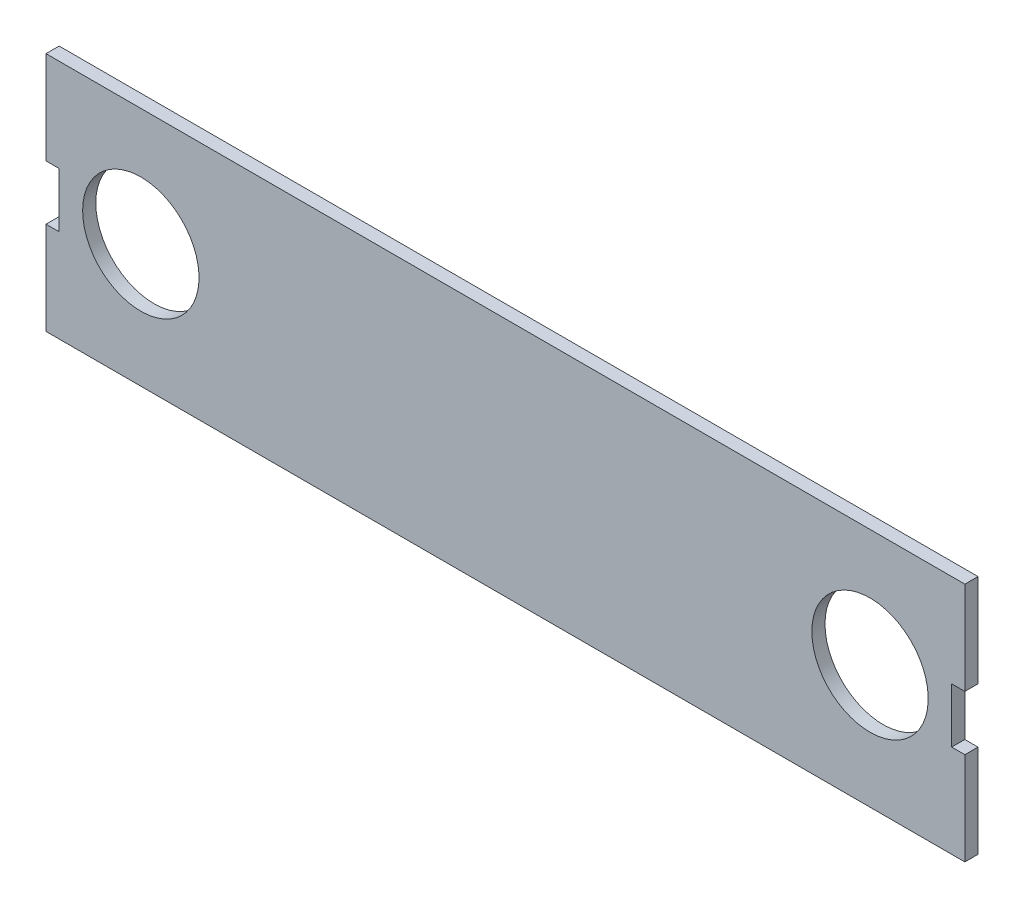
ISO-10303-21;
HEADER;
FILE_DESCRIPTION(('STEP AP214'),'2;1');
FILE_NAME('part.step','',(''),(''),'','','');
FILE_SCHEMA(('AUTOMOTIVE_DESIGN { 1 0 10303 214 1 1 1 1 }'));
ENDSEC;
DATA;
#1=APPLICATION_CONTEXT('core data for automotive mechanical design processes');
#2=APPLICATION_PROTOCOL_DEFINITION('international standard','automotive_design',2000,#1);
#3=PRODUCT_CONTEXT('',#1,'mechanical');
#4=PRODUCT('Part','Part','',(#3));
#5=PRODUCT_RELATED_PRODUCT_CATEGORY('part','',(#4));
#6=PRODUCT_DEFINITION_FORMATION('','',#4);
#7=PRODUCT_DEFINITION_CONTEXT('part definition',#1,'design');
#8=PRODUCT_DEFINITION('design','',#6,#7);
#9=PRODUCT_DEFINITION_SHAPE('','',#8);
#10=(LENGTH_UNIT() NAMED_UNIT(*) SI_UNIT(.MILLI.,.METRE.));
#11=(NAMED_UNIT(*) PLANE_ANGLE_UNIT() SI_UNIT($,.RADIAN.));
#12=(NAMED_UNIT(*) SI_UNIT($,.STERADIAN.) SOLID_ANGLE_UNIT());
#13=UNCERTAINTY_MEASURE_WITH_UNIT(LENGTH_MEASURE(1.E-05),#10,'distance_accuracy_value','');
#14=(GEOMETRIC_REPRESENTATION_CONTEXT(3) GLOBAL_UNCERTAINTY_ASSIGNED_CONTEXT((#13)) GLOBAL_UNIT_ASSIGNED_CONTEXT((#10,
#11,#12)) REPRESENTATION_CONTEXT('',''));
#15=CARTESIAN_POINT('',(0.,0.,0.));
#16=DIRECTION('',(0.,0.,1.));
#17=DIRECTION('',(1.,0.,0.));
#18=AXIS2_PLACEMENT_3D('',#15,#16,#17);
#19=CARTESIAN_POINT('',(0.,0.,1.524));
#20=DIRECTION('',(0.,0.,1.));
#21=DIRECTION('',(1.,0.,0.));
#22=AXIS2_PLACEMENT_3D('',#19,#20,#21);
#23=PLANE('',#22);
#24=CARTESIAN_POINT('',(9.46847857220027,-4.90502847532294,1.524));
#25=DIRECTION('',(0.,0.,1.));
#26=DIRECTION('',(1.,0.,0.));
#27=AXIS2_PLACEMENT_3D('',#24,#25,#26);
#28=CIRCLE('',#27,6.7437);
#29=CARTESIAN_POINT('',(2.72477857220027,-4.90502847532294,1.524));
#30=VERTEX_POINT('',#29);
#31=EDGE_CURVE('E161',#30,#30,#28,.T.);
#32=ORIENTED_EDGE('',*,*,#31,.F.);
#33=EDGE_LOOP('',(#32));
#34=FACE_BOUND('',#33,.T.);
#35=DIRECTION('',(0.,-1.,0.));
#36=VECTOR('',#35,1.);
#37=CARTESIAN_POINT('',(-1.524,8.71921233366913,1.524));
#38=LINE('',#37,#36);
#39=CARTESIAN_POINT('',(-1.524,8.71921233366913,1.524));
#40=VERTEX_POINT('',#39);
#41=CARTESIAN_POINT('',(-1.524,-2.05128085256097,1.524));
#42=VERTEX_POINT('',#41);
#43=EDGE_CURVE('E180',#40,#42,#38,.T.);
#44=ORIENTED_EDGE('',*,*,#43,.T.);
#45=DIRECTION('',(1.,0.,0.));
#46=VECTOR('',#45,1.);
#47=CARTESIAN_POINT('',(-1.524,-2.05128085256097,1.524));
#48=LINE('',#47,#46);
#49=CARTESIAN_POINT('',(0.,-2.05128085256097,1.524));
#50=VERTEX_POINT('',#49);
#51=EDGE_CURVE('E108',#42,#50,#48,.T.);
#52=ORIENTED_EDGE('',*,*,#51,.T.);
#53=DIRECTION('',(0.,-1.,0.));
#54=VECTOR('',#53,1.);
#55=CARTESIAN_POINT('',(0.,-2.05128085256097,1.524));
#56=LINE('',#55,#54);
#57=CARTESIAN_POINT('',(0.,-8.40128085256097,1.524));
#58=VERTEX_POINT('',#57);
#59=EDGE_CURVE('E207',#50,#58,#56,.T.);
#60=ORIENTED_EDGE('',*,*,#59,.T.);
#61=DIRECTION('',(-1.,0.,0.));
#62=VECTOR('',#61,1.);
#63=CARTESIAN_POINT('',(0.,-8.40128085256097,1.524));
#64=LINE('',#63,#62);
#65=CARTESIAN_POINT('',(-1.524,-8.40128085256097,1.524));
#66=VERTEX_POINT('',#65);
#67=EDGE_CURVE('E226',#58,#66,#64,.T.);
#68=ORIENTED_EDGE('',*,*,#67,.T.);
#69=DIRECTION('',(0.,-1.,0.));
#70=VECTOR('',#69,1.);
#71=CARTESIAN_POINT('',(-1.524,-8.40128085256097,1.524));
#72=LINE('',#71,#70);
#73=CARTESIAN_POINT('',(-1.524,-19.1717740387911,1.524));
#74=VERTEX_POINT('',#73);
#75=EDGE_CURVE('E223',#66,#74,#72,.T.);
#76=ORIENTED_EDGE('',*,*,#75,.T.);
#77=DIRECTION('',(1.,0.,0.));
#78=VECTOR('',#77,1.);
#79=CARTESIAN_POINT('',(-1.524,-19.1717740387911,1.524));
#80=LINE('',#79,#78);
#81=CARTESIAN_POINT('',(104.993300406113,-19.1717740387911,1.524));
#82=VERTEX_POINT('',#81);
#83=EDGE_CURVE('E225',#74,#82,#80,.T.);
#84=ORIENTED_EDGE('',*,*,#83,.T.);
#85=DIRECTION('',(0.,1.,0.));
#86=VECTOR('',#85,1.);
#87=CARTESIAN_POINT('',(104.993300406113,-8.40128085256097,1.524));
#88=LINE('',#87,#86);
#89=CARTESIAN_POINT('',(104.993300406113,-8.40128085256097,1.524));
#90=VERTEX_POINT('',#89);
#91=EDGE_CURVE('E228',#82,#90,#88,.T.);
#92=ORIENTED_EDGE('',*,*,#91,.T.);
#93=DIRECTION('',(-1.,0.,0.));
#94=VECTOR('',#93,1.);
#95=CARTESIAN_POINT('',(103.469300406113,-8.40128085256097,1.524));
#96=LINE('',#95,#94);
#97=CARTESIAN_POINT('',(103.469300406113,-8.40128085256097,1.524));
#98=VERTEX_POINT('',#97);
#99=EDGE_CURVE('E234',#90,#98,#96,.T.);
#100=ORIENTED_EDGE('',*,*,#99,.T.);
#101=DIRECTION('',(0.,1.,0.));
#102=VECTOR('',#101,1.);
#103=CARTESIAN_POINT('',(103.469300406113,-2.05128085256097,1.524));
#104=LINE('',#103,#102);
#105=CARTESIAN_POINT('',(103.469300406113,-2.05128085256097,1.524));
#106=VERTEX_POINT('',#105);
#107=EDGE_CURVE('E139',#98,#106,#104,.T.);
#108=ORIENTED_EDGE('',*,*,#107,.T.);
#109=DIRECTION('',(1.,0.,0.));
#110=VECTOR('',#109,1.);
#111=CARTESIAN_POINT('',(104.993300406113,-2.05128085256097,1.524));
#112=LINE('',#111,#110);
#113=CARTESIAN_POINT('',(104.993300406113,-2.05128085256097,1.524));
#114=VERTEX_POINT('',#113);
#115=EDGE_CURVE('E133',#106,#114,#112,.T.);
#116=ORIENTED_EDGE('',*,*,#115,.T.);
#117=DIRECTION('',(0.,1.,0.));
#118=VECTOR('',#117,1.);
#119=CARTESIAN_POINT('',(104.993300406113,8.71921233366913,1.524));
#120=LINE('',#119,#118);
#121=CARTESIAN_POINT('',(104.993300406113,8.71921233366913,1.524));
#122=VERTEX_POINT('',#121);
#123=EDGE_CURVE('E137',#114,#122,#120,.T.);
#124=ORIENTED_EDGE('',*,*,#123,.T.);
#125=DIRECTION('',(-1.,0.,0.));
#126=VECTOR('',#125,1.);
#127=CARTESIAN_POINT('',(-1.524,8.71921233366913,1.524));
#128=LINE('',#127,#126);
#129=EDGE_CURVE('E53',#122,#40,#128,.T.);
#130=ORIENTED_EDGE('',*,*,#129,.T.);
#131=EDGE_LOOP('',(#44,#52,#60,#68,#76,#84,#92,#100,#108,#116,#124,#130));
#132=FACE_BOUND('',#131,.T.);
#133=CARTESIAN_POINT('',(94.0008218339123,-4.90502847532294,1.524));
#134=DIRECTION('',(0.,0.,1.));
#135=DIRECTION('',(-1.,0.,0.));
#136=AXIS2_PLACEMENT_3D('',#133,#134,#135);
#137=CIRCLE('',#136,6.74369999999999);
#138=CARTESIAN_POINT('',(87.2571218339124,-4.90502847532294,1.524));
#139=VERTEX_POINT('',#138);
#140=EDGE_CURVE('E277',#139,#139,#137,.T.);
#141=ORIENTED_EDGE('',*,*,#140,.F.);
#142=EDGE_LOOP('',(#141));
#143=FACE_BOUND('',#142,.T.);
#144=ADVANCED_FACE('F36',(#34,#132,#143),#23,.T.);
#145=CARTESIAN_POINT('',(0.,0.,0.));
#146=DIRECTION('',(0.,0.,1.));
#147=DIRECTION('',(1.,0.,0.));
#148=AXIS2_PLACEMENT_3D('',#145,#146,#147);
#149=PLANE('',#148);
#150=CARTESIAN_POINT('',(9.46847857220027,-4.90502847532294,0.));
#151=DIRECTION('',(0.,0.,1.));
#152=DIRECTION('',(1.,0.,0.));
#153=AXIS2_PLACEMENT_3D('',#150,#151,#152);
#154=CIRCLE('',#153,6.7437);
#155=CARTESIAN_POINT('',(2.72477857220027,-4.90502847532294,0.));
#156=VERTEX_POINT('',#155);
#157=EDGE_CURVE('E282',#156,#156,#154,.T.);
#158=ORIENTED_EDGE('',*,*,#157,.T.);
#159=EDGE_LOOP('',(#158));
#160=FACE_BOUND('',#159,.T.);
#161=DIRECTION('',(0.,-1.,0.));
#162=VECTOR('',#161,1.);
#163=CARTESIAN_POINT('',(-1.524,8.71921233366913,0.));
#164=LINE('',#163,#162);
#165=CARTESIAN_POINT('',(-1.524,8.71921233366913,0.));
#166=VERTEX_POINT('',#165);
#167=CARTESIAN_POINT('',(-1.524,-2.05128085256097,0.));
#168=VERTEX_POINT('',#167);
#169=EDGE_CURVE('E157',#166,#168,#164,.T.);
#170=ORIENTED_EDGE('',*,*,#169,.F.);
#171=DIRECTION('',(-1.,0.,0.));
#172=VECTOR('',#171,1.);
#173=CARTESIAN_POINT('',(-1.524,8.71921233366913,0.));
#174=LINE('',#173,#172);
#175=CARTESIAN_POINT('',(104.993300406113,8.71921233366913,0.));
#176=VERTEX_POINT('',#175);
#177=EDGE_CURVE('E100',#176,#166,#174,.T.);
#178=ORIENTED_EDGE('',*,*,#177,.F.);
#179=DIRECTION('',(0.,1.,0.));
#180=VECTOR('',#179,1.);
#181=CARTESIAN_POINT('',(104.993300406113,8.71921233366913,0.));
#182=LINE('',#181,#180);
#183=CARTESIAN_POINT('',(104.993300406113,-2.05128085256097,0.));
#184=VERTEX_POINT('',#183);
#185=EDGE_CURVE('E94',#184,#176,#182,.T.);
#186=ORIENTED_EDGE('',*,*,#185,.F.);
#187=DIRECTION('',(1.,0.,0.));
#188=VECTOR('',#187,1.);
#189=CARTESIAN_POINT('',(104.993300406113,-2.05128085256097,0.));
#190=LINE('',#189,#188);
#191=CARTESIAN_POINT('',(103.469300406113,-2.05128085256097,0.));
#192=VERTEX_POINT('',#191);
#193=EDGE_CURVE('E147',#192,#184,#190,.T.);
#194=ORIENTED_EDGE('',*,*,#193,.F.);
#195=DIRECTION('',(0.,1.,0.));
#196=VECTOR('',#195,1.);
#197=CARTESIAN_POINT('',(103.469300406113,-2.05128085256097,0.));
#198=LINE('',#197,#196);
#199=CARTESIAN_POINT('',(103.469300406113,-8.40128085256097,0.));
#200=VERTEX_POINT('',#199);
#201=EDGE_CURVE('E175',#200,#192,#198,.T.);
#202=ORIENTED_EDGE('',*,*,#201,.F.);
#203=DIRECTION('',(-1.,0.,0.));
#204=VECTOR('',#203,1.);
#205=CARTESIAN_POINT('',(103.469300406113,-8.40128085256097,0.));
#206=LINE('',#205,#204);
#207=CARTESIAN_POINT('',(104.993300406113,-8.40128085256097,0.));
#208=VERTEX_POINT('',#207);
#209=EDGE_CURVE('E173',#208,#200,#206,.T.);
#210=ORIENTED_EDGE('',*,*,#209,.F.);
#211=DIRECTION('',(0.,1.,0.));
#212=VECTOR('',#211,1.);
#213=CARTESIAN_POINT('',(104.993300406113,-8.40128085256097,0.));
#214=LINE('',#213,#212);
#215=CARTESIAN_POINT('',(104.993300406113,-19.1717740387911,0.));
#216=VERTEX_POINT('',#215);
#217=EDGE_CURVE('E171',#216,#208,#214,.T.);
#218=ORIENTED_EDGE('',*,*,#217,.F.);
#219=DIRECTION('',(1.,0.,0.));
#220=VECTOR('',#219,1.);
#221=CARTESIAN_POINT('',(-1.524,-19.1717740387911,0.));
#222=LINE('',#221,#220);
#223=CARTESIAN_POINT('',(-1.524,-19.1717740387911,0.));
#224=VERTEX_POINT('',#223);
#225=EDGE_CURVE('E169',#224,#216,#222,.T.);
#226=ORIENTED_EDGE('',*,*,#225,.F.);
#227=DIRECTION('',(0.,-1.,0.));
#228=VECTOR('',#227,1.);
#229=CARTESIAN_POINT('',(-1.524,-8.40128085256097,0.));
#230=LINE('',#229,#228);
#231=CARTESIAN_POINT('',(-1.524,-8.40128085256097,0.));
#232=VERTEX_POINT('',#231);
#233=EDGE_CURVE('E167',#232,#224,#230,.T.);
#234=ORIENTED_EDGE('',*,*,#233,.F.);
#235=DIRECTION('',(-1.,0.,0.));
#236=VECTOR('',#235,1.);
#237=CARTESIAN_POINT('',(0.,-8.40128085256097,0.));
#238=LINE('',#237,#236);
#239=CARTESIAN_POINT('',(0.,-8.40128085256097,0.));
#240=VERTEX_POINT('',#239);
#241=EDGE_CURVE('E165',#240,#232,#238,.T.);
#242=ORIENTED_EDGE('',*,*,#241,.F.);
#243=DIRECTION('',(0.,-1.,0.));
#244=VECTOR('',#243,1.);
#245=CARTESIAN_POINT('',(0.,-2.05128085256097,0.));
#246=LINE('',#245,#244);
#247=CARTESIAN_POINT('',(0.,-2.05128085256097,0.));
#248=VERTEX_POINT('',#247);
#249=EDGE_CURVE('E163',#248,#240,#246,.T.);
#250=ORIENTED_EDGE('',*,*,#249,.F.);
#251=DIRECTION('',(1.,0.,0.));
#252=VECTOR('',#251,1.);
#253=CARTESIAN_POINT('',(-1.524,-2.05128085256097,0.));
#254=LINE('',#253,#252);
#255=EDGE_CURVE('E160',#168,#248,#254,.T.);
#256=ORIENTED_EDGE('',*,*,#255,.F.);
#257=EDGE_LOOP('',(#170,#178,#186,#194,#202,#210,#218,#226,#234,#242,#250,#256));
#258=FACE_BOUND('',#257,.T.);
#259=CARTESIAN_POINT('',(94.0008218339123,-4.90502847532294,0.));
#260=DIRECTION('',(0.,0.,1.));
#261=DIRECTION('',(-1.,0.,0.));
#262=AXIS2_PLACEMENT_3D('',#259,#260,#261);
#263=CIRCLE('',#262,6.74369999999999);
#264=CARTESIAN_POINT('',(87.2571218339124,-4.90502847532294,0.));
#265=VERTEX_POINT('',#264);
#266=EDGE_CURVE('E280',#265,#265,#263,.T.);
#267=ORIENTED_EDGE('',*,*,#266,.T.);
#268=EDGE_LOOP('',(#267));
#269=FACE_BOUND('',#268,.T.);
#270=ADVANCED_FACE('F211',(#160,#258,#269),#149,.F.);
#271=CARTESIAN_POINT('',(-1.524,8.71921233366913,1.524));
#272=DIRECTION('',(1.,0.,0.));
#273=DIRECTION('',(0.,0.,-1.));
#274=AXIS2_PLACEMENT_3D('',#271,#272,#273);
#275=PLANE('',#274);
#276=ORIENTED_EDGE('',*,*,#169,.T.);
#277=DIRECTION('',(0.,0.,-1.));
#278=VECTOR('',#277,1.);
#279=CARTESIAN_POINT('',(-1.524,-2.05128085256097,1.524));
#280=LINE('',#279,#278);
#281=EDGE_CURVE('E11',#42,#168,#280,.T.);
#282=ORIENTED_EDGE('',*,*,#281,.F.);
#283=ORIENTED_EDGE('',*,*,#43,.F.);
#284=DIRECTION('',(0.,0.,-1.));
#285=VECTOR('',#284,1.);
#286=CARTESIAN_POINT('',(-1.524,8.71921233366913,1.524));
#287=LINE('',#286,#285);
#288=EDGE_CURVE('E153',#40,#166,#287,.T.);
#289=ORIENTED_EDGE('',*,*,#288,.T.);
#290=EDGE_LOOP('',(#276,#282,#283,#289));
#291=FACE_BOUND('',#290,.T.);
#292=ADVANCED_FACE('F38',(#291),#275,.F.);
#293=CARTESIAN_POINT('',(-1.524,-2.05128085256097,1.524));
#294=DIRECTION('',(0.,1.,0.));
#295=DIRECTION('',(0.,0.,1.));
#296=AXIS2_PLACEMENT_3D('',#293,#294,#295);
#297=PLANE('',#296);
#298=ORIENTED_EDGE('',*,*,#255,.T.);
#299=DIRECTION('',(0.,0.,-1.));
#300=VECTOR('',#299,1.);
#301=CARTESIAN_POINT('',(0.,-2.05128085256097,1.524));
#302=LINE('',#301,#300);
#303=EDGE_CURVE('E45',#50,#248,#302,.T.);
#304=ORIENTED_EDGE('',*,*,#303,.F.);
#305=ORIENTED_EDGE('',*,*,#51,.F.);
#306=ORIENTED_EDGE('',*,*,#281,.T.);
#307=EDGE_LOOP('',(#298,#304,#305,#306));
#308=FACE_BOUND('',#307,.T.);
#309=ADVANCED_FACE('F375',(#308),#297,.F.);
#310=CARTESIAN_POINT('',(0.,-2.05128085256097,1.524));
#311=DIRECTION('',(1.,0.,0.));
#312=DIRECTION('',(0.,0.,-1.));
#313=AXIS2_PLACEMENT_3D('',#310,#311,#312);
#314=PLANE('',#313);
#315=ORIENTED_EDGE('',*,*,#249,.T.);
#316=DIRECTION('',(0.,0.,-1.));
#317=VECTOR('',#316,1.);
#318=CARTESIAN_POINT('',(0.,-8.40128085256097,1.524));
#319=LINE('',#318,#317);
#320=EDGE_CURVE('E199',#58,#240,#319,.T.);
#321=ORIENTED_EDGE('',*,*,#320,.F.);
#322=ORIENTED_EDGE('',*,*,#59,.F.);
#323=ORIENTED_EDGE('',*,*,#303,.T.);
#324=EDGE_LOOP('',(#315,#321,#322,#323));
#325=FACE_BOUND('',#324,.T.);
#326=ADVANCED_FACE('F205',(#325),#314,.F.);
#327=CARTESIAN_POINT('',(0.,-8.40128085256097,1.524));
#328=DIRECTION('',(0.,-1.,0.));
#329=DIRECTION('',(0.,0.,-1.));
#330=AXIS2_PLACEMENT_3D('',#327,#328,#329);
#331=PLANE('',#330);
#332=ORIENTED_EDGE('',*,*,#241,.T.);
#333=DIRECTION('',(0.,0.,-1.));
#334=VECTOR('',#333,1.);
#335=CARTESIAN_POINT('',(-1.524,-8.40128085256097,1.524));
#336=LINE('',#335,#334);
#337=EDGE_CURVE('E196',#66,#232,#336,.T.);
#338=ORIENTED_EDGE('',*,*,#337,.F.);
#339=ORIENTED_EDGE('',*,*,#67,.F.);
#340=ORIENTED_EDGE('',*,*,#320,.T.);
#341=EDGE_LOOP('',(#332,#338,#339,#340));
#342=FACE_BOUND('',#341,.T.);
#343=ADVANCED_FACE('F217',(#342),#331,.F.);
#344=CARTESIAN_POINT('',(-1.524,-8.40128085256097,1.524));
#345=DIRECTION('',(1.,0.,0.));
#346=DIRECTION('',(0.,0.,-1.));
#347=AXIS2_PLACEMENT_3D('',#344,#345,#346);
#348=PLANE('',#347);
#349=ORIENTED_EDGE('',*,*,#233,.T.);
#350=DIRECTION('',(0.,0.,-1.));
#351=VECTOR('',#350,1.);
#352=CARTESIAN_POINT('',(-1.524,-19.1717740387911,1.524));
#353=LINE('',#352,#351);
#354=EDGE_CURVE('E193',#74,#224,#353,.T.);
#355=ORIENTED_EDGE('',*,*,#354,.F.);
#356=ORIENTED_EDGE('',*,*,#75,.F.);
#357=ORIENTED_EDGE('',*,*,#337,.T.);
#358=EDGE_LOOP('',(#349,#355,#356,#357));
#359=FACE_BOUND('',#358,.T.);
#360=ADVANCED_FACE('F221',(#359),#348,.F.);
#361=CARTESIAN_POINT('',(-1.524,-19.1717740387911,1.524));
#362=DIRECTION('',(0.,1.,0.));
#363=DIRECTION('',(0.,0.,1.));
#364=AXIS2_PLACEMENT_3D('',#361,#362,#363);
#365=PLANE('',#364);
#366=ORIENTED_EDGE('',*,*,#225,.T.);
#367=DIRECTION('',(0.,0.,-1.));
#368=VECTOR('',#367,1.);
#369=CARTESIAN_POINT('',(104.993300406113,-19.1717740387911,1.524));
#370=LINE('',#369,#368);
#371=EDGE_CURVE('E190',#82,#216,#370,.T.);
#372=ORIENTED_EDGE('',*,*,#371,.F.);
#373=ORIENTED_EDGE('',*,*,#83,.F.);
#374=ORIENTED_EDGE('',*,*,#354,.T.);
#375=EDGE_LOOP('',(#366,#372,#373,#374));
#376=FACE_BOUND('',#375,.T.);
#377=ADVANCED_FACE('F340',(#376),#365,.F.);
#378=CARTESIAN_POINT('',(104.993300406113,-8.40128085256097,1.524));
#379=DIRECTION('',(-1.,0.,0.));
#380=DIRECTION('',(0.,0.,1.));
#381=AXIS2_PLACEMENT_3D('',#378,#379,#380);
#382=PLANE('',#381);
#383=ORIENTED_EDGE('',*,*,#217,.T.);
#384=DIRECTION('',(0.,0.,-1.));
#385=VECTOR('',#384,1.);
#386=CARTESIAN_POINT('',(104.993300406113,-8.40128085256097,1.524));
#387=LINE('',#386,#385);
#388=EDGE_CURVE('E187',#90,#208,#387,.T.);
#389=ORIENTED_EDGE('',*,*,#388,.F.);
#390=ORIENTED_EDGE('',*,*,#91,.F.);
#391=ORIENTED_EDGE('',*,*,#371,.T.);
#392=EDGE_LOOP('',(#383,#389,#390,#391));
#393=FACE_BOUND('',#392,.T.);
#394=ADVANCED_FACE('F331',(#393),#382,.F.);
#395=CARTESIAN_POINT('',(103.469300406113,-8.40128085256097,1.524));
#396=DIRECTION('',(0.,-1.,0.));
#397=DIRECTION('',(0.,0.,-1.));
#398=AXIS2_PLACEMENT_3D('',#395,#396,#397);
#399=PLANE('',#398);
#400=ORIENTED_EDGE('',*,*,#209,.T.);
#401=DIRECTION('',(0.,0.,-1.));
#402=VECTOR('',#401,1.);
#403=CARTESIAN_POINT('',(103.469300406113,-8.40128085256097,1.524));
#404=LINE('',#403,#402);
#405=EDGE_CURVE('E184',#98,#200,#404,.T.);
#406=ORIENTED_EDGE('',*,*,#405,.F.);
#407=ORIENTED_EDGE('',*,*,#99,.F.);
#408=ORIENTED_EDGE('',*,*,#388,.T.);
#409=EDGE_LOOP('',(#400,#406,#407,#408));
#410=FACE_BOUND('',#409,.T.);
#411=ADVANCED_FACE('F240',(#410),#399,.F.);
#412=CARTESIAN_POINT('',(103.469300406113,-2.05128085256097,1.524));
#413=DIRECTION('',(-1.,0.,0.));
#414=DIRECTION('',(0.,0.,1.));
#415=AXIS2_PLACEMENT_3D('',#412,#413,#414);
#416=PLANE('',#415);
#417=ORIENTED_EDGE('',*,*,#201,.T.);
#418=DIRECTION('',(0.,0.,-1.));
#419=VECTOR('',#418,1.);
#420=CARTESIAN_POINT('',(103.469300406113,-2.05128085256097,1.524));
#421=LINE('',#420,#419);
#422=EDGE_CURVE('E148',#106,#192,#421,.T.);
#423=ORIENTED_EDGE('',*,*,#422,.F.);
#424=ORIENTED_EDGE('',*,*,#107,.F.);
#425=ORIENTED_EDGE('',*,*,#405,.T.);
#426=EDGE_LOOP('',(#417,#423,#424,#425));
#427=FACE_BOUND('',#426,.T.);
#428=ADVANCED_FACE('F244',(#427),#416,.F.);
#429=CARTESIAN_POINT('',(104.993300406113,-2.05128085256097,1.524));
#430=DIRECTION('',(0.,1.,0.));
#431=DIRECTION('',(0.,0.,1.));
#432=AXIS2_PLACEMENT_3D('',#429,#430,#431);
#433=PLANE('',#432);
#434=ORIENTED_EDGE('',*,*,#193,.T.);
#435=DIRECTION('',(0.,0.,-1.));
#436=VECTOR('',#435,1.);
#437=CARTESIAN_POINT('',(104.993300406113,-2.05128085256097,1.524));
#438=LINE('',#437,#436);
#439=EDGE_CURVE('E144',#114,#184,#438,.T.);
#440=ORIENTED_EDGE('',*,*,#439,.F.);
#441=ORIENTED_EDGE('',*,*,#115,.F.);
#442=ORIENTED_EDGE('',*,*,#422,.T.);
#443=EDGE_LOOP('',(#434,#440,#441,#442));
#444=FACE_BOUND('',#443,.T.);
#445=ADVANCED_FACE('F145',(#444),#433,.F.);
#446=CARTESIAN_POINT('',(104.993300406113,8.71921233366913,1.524));
#447=DIRECTION('',(-1.,0.,0.));
#448=DIRECTION('',(0.,0.,1.));
#449=AXIS2_PLACEMENT_3D('',#446,#447,#448);
#450=PLANE('',#449);
#451=ORIENTED_EDGE('',*,*,#185,.T.);
#452=DIRECTION('',(0.,0.,-1.));
#453=VECTOR('',#452,1.);
#454=CARTESIAN_POINT('',(104.993300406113,8.71921233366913,1.524));
#455=LINE('',#454,#453);
#456=EDGE_CURVE('E149',#122,#176,#455,.T.);
#457=ORIENTED_EDGE('',*,*,#456,.F.);
#458=ORIENTED_EDGE('',*,*,#123,.F.);
#459=ORIENTED_EDGE('',*,*,#439,.T.);
#460=EDGE_LOOP('',(#451,#457,#458,#459));
#461=FACE_BOUND('',#460,.T.);
#462=ADVANCED_FACE('F151',(#461),#450,.F.);
#463=CARTESIAN_POINT('',(-1.524,8.71921233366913,1.524));
#464=DIRECTION('',(0.,-1.,0.));
#465=DIRECTION('',(0.,0.,-1.));
#466=AXIS2_PLACEMENT_3D('',#463,#464,#465);
#467=PLANE('',#466);
#468=ORIENTED_EDGE('',*,*,#177,.T.);
#469=ORIENTED_EDGE('',*,*,#288,.F.);
#470=ORIENTED_EDGE('',*,*,#129,.F.);
#471=ORIENTED_EDGE('',*,*,#456,.T.);
#472=EDGE_LOOP('',(#468,#469,#470,#471));
#473=FACE_BOUND('',#472,.T.);
#474=ADVANCED_FACE('F248',(#473),#467,.F.);
#475=CARTESIAN_POINT('',(9.46847857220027,-4.90502847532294,1.524));
#476=DIRECTION('',(0.,0.,-1.));
#477=DIRECTION('',(-1.,0.,0.));
#478=AXIS2_PLACEMENT_3D('',#475,#476,#477);
#479=CYLINDRICAL_SURFACE('',#478,6.7437);
#480=CARTESIAN_POINT('',(2.72477857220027,-4.90502847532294,1.524));
#481=CARTESIAN_POINT('',(2.72477857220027,-4.90502847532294,1.508125));
#482=CARTESIAN_POINT('',(2.72477857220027,-4.90502847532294,1.49225));
#483=CARTESIAN_POINT('',(2.72477857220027,-4.90502847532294,1.4605));
#484=CARTESIAN_POINT('',(2.72477857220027,-4.90502847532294,1.444625));
#485=CARTESIAN_POINT('',(2.72477857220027,-4.90502847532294,1.412875));
#486=CARTESIAN_POINT('',(2.72477857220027,-4.90502847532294,1.397));
#487=CARTESIAN_POINT('',(2.72477857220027,-4.90502847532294,1.36525));
#488=CARTESIAN_POINT('',(2.72477857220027,-4.90502847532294,1.349375));
#489=CARTESIAN_POINT('',(2.72477857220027,-4.90502847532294,1.317625));
#490=CARTESIAN_POINT('',(2.72477857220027,-4.90502847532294,1.30175));
#491=CARTESIAN_POINT('',(2.72477857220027,-4.90502847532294,1.27));
#492=CARTESIAN_POINT('',(2.72477857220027,-4.90502847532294,1.254125));
#493=CARTESIAN_POINT('',(2.72477857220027,-4.90502847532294,1.222375));
#494=CARTESIAN_POINT('',(2.72477857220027,-4.90502847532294,1.2065));
#495=CARTESIAN_POINT('',(2.72477857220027,-4.90502847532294,1.17475));
#496=CARTESIAN_POINT('',(2.72477857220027,-4.90502847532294,1.158875));
#497=CARTESIAN_POINT('',(2.72477857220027,-4.90502847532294,1.127125));
#498=CARTESIAN_POINT('',(2.72477857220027,-4.90502847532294,1.11125));
#499=CARTESIAN_POINT('',(2.72477857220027,-4.90502847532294,1.0795));
#500=CARTESIAN_POINT('',(2.72477857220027,-4.90502847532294,1.063625));
#501=CARTESIAN_POINT('',(2.72477857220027,-4.90502847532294,1.031875));
#502=CARTESIAN_POINT('',(2.72477857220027,-4.90502847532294,1.016));
#503=CARTESIAN_POINT('',(2.72477857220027,-4.90502847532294,0.98425));
#504=CARTESIAN_POINT('',(2.72477857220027,-4.90502847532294,0.968375));
#505=CARTESIAN_POINT('',(2.72477857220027,-4.90502847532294,0.936625));
#506=CARTESIAN_POINT('',(2.72477857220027,-4.90502847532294,0.92075));
#507=CARTESIAN_POINT('',(2.72477857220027,-4.90502847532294,0.889));
#508=CARTESIAN_POINT('',(2.72477857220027,-4.90502847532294,0.873125));
#509=CARTESIAN_POINT('',(2.72477857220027,-4.90502847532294,0.841375));
#510=CARTESIAN_POINT('',(2.72477857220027,-4.90502847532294,0.8255));
#511=CARTESIAN_POINT('',(2.72477857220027,-4.90502847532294,0.79375));
#512=CARTESIAN_POINT('',(2.72477857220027,-4.90502847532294,0.777875));
#513=CARTESIAN_POINT('',(2.72477857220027,-4.90502847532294,0.746125));
#514=CARTESIAN_POINT('',(2.72477857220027,-4.90502847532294,0.73025));
#515=CARTESIAN_POINT('',(2.72477857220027,-4.90502847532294,0.6985));
#516=CARTESIAN_POINT('',(2.72477857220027,-4.90502847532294,0.682625));
#517=CARTESIAN_POINT('',(2.72477857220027,-4.90502847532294,0.650875));
#518=CARTESIAN_POINT('',(2.72477857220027,-4.90502847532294,0.635));
#519=CARTESIAN_POINT('',(2.72477857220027,-4.90502847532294,0.60325));
#520=CARTESIAN_POINT('',(2.72477857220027,-4.90502847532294,0.587375));
#521=CARTESIAN_POINT('',(2.72477857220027,-4.90502847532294,0.555625));
#522=CARTESIAN_POINT('',(2.72477857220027,-4.90502847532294,0.53975));
#523=CARTESIAN_POINT('',(2.72477857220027,-4.90502847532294,0.508));
#524=CARTESIAN_POINT('',(2.72477857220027,-4.90502847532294,0.492125));
#525=CARTESIAN_POINT('',(2.72477857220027,-4.90502847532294,0.460375));
#526=CARTESIAN_POINT('',(2.72477857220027,-4.90502847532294,0.4445));
#527=CARTESIAN_POINT('',(2.72477857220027,-4.90502847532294,0.41275));
#528=CARTESIAN_POINT('',(2.72477857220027,-4.90502847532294,0.396875));
#529=CARTESIAN_POINT('',(2.72477857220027,-4.90502847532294,0.365125));
#530=CARTESIAN_POINT('',(2.72477857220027,-4.90502847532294,0.34925));
#531=CARTESIAN_POINT('',(2.72477857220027,-4.90502847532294,0.3175));
#532=CARTESIAN_POINT('',(2.72477857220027,-4.90502847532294,0.301625));
#533=CARTESIAN_POINT('',(2.72477857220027,-4.90502847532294,0.269875));
#534=CARTESIAN_POINT('',(2.72477857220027,-4.90502847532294,0.254));
#535=CARTESIAN_POINT('',(2.72477857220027,-4.90502847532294,0.22225));
#536=CARTESIAN_POINT('',(2.72477857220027,-4.90502847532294,0.206375));
#537=CARTESIAN_POINT('',(2.72477857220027,-4.90502847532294,0.174625));
#538=CARTESIAN_POINT('',(2.72477857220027,-4.90502847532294,0.15875));
#539=CARTESIAN_POINT('',(2.72477857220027,-4.90502847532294,0.127));
#540=CARTESIAN_POINT('',(2.72477857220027,-4.90502847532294,0.111125));
#541=CARTESIAN_POINT('',(2.72477857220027,-4.90502847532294,0.079375));
#542=CARTESIAN_POINT('',(2.72477857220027,-4.90502847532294,0.0635));
#543=CARTESIAN_POINT('',(2.72477857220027,-4.90502847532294,0.0317499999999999));
#544=CARTESIAN_POINT('',(2.72477857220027,-4.90502847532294,0.015875));
#545=CARTESIAN_POINT('',(2.72477857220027,-4.90502847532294,0.));
#546=B_SPLINE_CURVE_WITH_KNOTS('',3,(#480,#481,#482,#483,#484,#485,#486,#487,#488,#489,#490,
#491,#492,#493,#494,#495,#496,#497,#498,#499,#500,#501,#502,#503,#504,#505,#506,#507,#508,#509,
#510,#511,#512,#513,#514,#515,#516,#517,#518,#519,#520,#521,#522,#523,#524,#525,#526,#527,#528,
#529,#530,#531,#532,#533,#534,#535,#536,#537,#538,#539,#540,#541,#542,#543,#544,#545),
.UNSPECIFIED.,.F.,.F.,(4,2,2,2,2,2,2,2,2,2,2,2,2,2,2,2,2,2,2,2,2,2,2,2,2,2,2,2,2,2,2,2,4),(0.,
0.0476249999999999,0.0952499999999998,0.142875,0.1905,0.238125,0.28575,0.333375,0.381,0.428625,
0.47625,0.523875,0.5715,0.619125,0.66675,0.714375,0.762,0.809625,0.85725,0.904875,0.9525,
1.000125,1.04775,1.095375,1.143,1.190625,1.23825,1.285875,1.3335,1.381125,1.42875,1.476375,
1.524),.UNSPECIFIED.);
#547=EDGE_CURVE('BSEAM250',#30,#156,#546,.T.);
#548=ORIENTED_EDGE('',*,*,#31,.T.);
#549=ORIENTED_EDGE('',*,*,#157,.F.);
#550=ORIENTED_EDGE('',*,*,#547,.T.);
#551=ORIENTED_EDGE('',*,*,#547,.F.);
#552=EDGE_LOOP('',(#548,#550,#549,#551));
#553=FACE_BOUND('',#552,.T.);
#554=ADVANCED_FACE('F250',(#553),#479,.F.);
#555=CARTESIAN_POINT('',(94.0008218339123,-4.90502847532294,1.524));
#556=DIRECTION('',(0.,0.,-1.));
#557=DIRECTION('',(-1.,0.,0.));
#558=AXIS2_PLACEMENT_3D('',#555,#556,#557);
#559=CYLINDRICAL_SURFACE('',#558,6.74369999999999);
#560=CARTESIAN_POINT('',(87.2571218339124,-4.90502847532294,1.524));
#561=CARTESIAN_POINT('',(87.2571218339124,-4.90502847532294,1.508125));
#562=CARTESIAN_POINT('',(87.2571218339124,-4.90502847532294,1.49225));
#563=CARTESIAN_POINT('',(87.2571218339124,-4.90502847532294,1.4605));
#564=CARTESIAN_POINT('',(87.2571218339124,-4.90502847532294,1.444625));
#565=CARTESIAN_POINT('',(87.2571218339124,-4.90502847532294,1.412875));
#566=CARTESIAN_POINT('',(87.2571218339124,-4.90502847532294,1.397));
#567=CARTESIAN_POINT('',(87.2571218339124,-4.90502847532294,1.36525));
#568=CARTESIAN_POINT('',(87.2571218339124,-4.90502847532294,1.349375));
#569=CARTESIAN_POINT('',(87.2571218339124,-4.90502847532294,1.317625));
#570=CARTESIAN_POINT('',(87.2571218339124,-4.90502847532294,1.30175));
#571=CARTESIAN_POINT('',(87.2571218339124,-4.90502847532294,1.27));
#572=CARTESIAN_POINT('',(87.2571218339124,-4.90502847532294,1.254125));
#573=CARTESIAN_POINT('',(87.2571218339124,-4.90502847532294,1.222375));
#574=CARTESIAN_POINT('',(87.2571218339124,-4.90502847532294,1.2065));
#575=CARTESIAN_POINT('',(87.2571218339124,-4.90502847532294,1.17475));
#576=CARTESIAN_POINT('',(87.2571218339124,-4.90502847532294,1.158875));
#577=CARTESIAN_POINT('',(87.2571218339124,-4.90502847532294,1.127125));
#578=CARTESIAN_POINT('',(87.2571218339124,-4.90502847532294,1.11125));
#579=CARTESIAN_POINT('',(87.2571218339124,-4.90502847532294,1.0795));
#580=CARTESIAN_POINT('',(87.2571218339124,-4.90502847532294,1.063625));
#581=CARTESIAN_POINT('',(87.2571218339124,-4.90502847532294,1.031875));
#582=CARTESIAN_POINT('',(87.2571218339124,-4.90502847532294,1.016));
#583=CARTESIAN_POINT('',(87.2571218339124,-4.90502847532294,0.98425));
#584=CARTESIAN_POINT('',(87.2571218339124,-4.90502847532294,0.968375));
#585=CARTESIAN_POINT('',(87.2571218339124,-4.90502847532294,0.936625));
#586=CARTESIAN_POINT('',(87.2571218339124,-4.90502847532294,0.92075));
#587=CARTESIAN_POINT('',(87.2571218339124,-4.90502847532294,0.889));
#588=CARTESIAN_POINT('',(87.2571218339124,-4.90502847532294,0.873125));
#589=CARTESIAN_POINT('',(87.2571218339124,-4.90502847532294,0.841375));
#590=CARTESIAN_POINT('',(87.2571218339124,-4.90502847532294,0.8255));
#591=CARTESIAN_POINT('',(87.2571218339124,-4.90502847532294,0.79375));
#592=CARTESIAN_POINT('',(87.2571218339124,-4.90502847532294,0.777875));
#593=CARTESIAN_POINT('',(87.2571218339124,-4.90502847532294,0.746125));
#594=CARTESIAN_POINT('',(87.2571218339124,-4.90502847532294,0.73025));
#595=CARTESIAN_POINT('',(87.2571218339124,-4.90502847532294,0.6985));
#596=CARTESIAN_POINT('',(87.2571218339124,-4.90502847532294,0.682625));
#597=CARTESIAN_POINT('',(87.2571218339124,-4.90502847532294,0.650875));
#598=CARTESIAN_POINT('',(87.2571218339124,-4.90502847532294,0.635));
#599=CARTESIAN_POINT('',(87.2571218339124,-4.90502847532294,0.60325));
#600=CARTESIAN_POINT('',(87.2571218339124,-4.90502847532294,0.587375));
#601=CARTESIAN_POINT('',(87.2571218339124,-4.90502847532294,0.555625));
#602=CARTESIAN_POINT('',(87.2571218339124,-4.90502847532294,0.53975));
#603=CARTESIAN_POINT('',(87.2571218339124,-4.90502847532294,0.508));
#604=CARTESIAN_POINT('',(87.2571218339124,-4.90502847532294,0.492125));
#605=CARTESIAN_POINT('',(87.2571218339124,-4.90502847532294,0.460375));
#606=CARTESIAN_POINT('',(87.2571218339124,-4.90502847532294,0.4445));
#607=CARTESIAN_POINT('',(87.2571218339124,-4.90502847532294,0.41275));
#608=CARTESIAN_POINT('',(87.2571218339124,-4.90502847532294,0.396875));
#609=CARTESIAN_POINT('',(87.2571218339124,-4.90502847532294,0.365125));
#610=CARTESIAN_POINT('',(87.2571218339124,-4.90502847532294,0.34925));
#611=CARTESIAN_POINT('',(87.2571218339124,-4.90502847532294,0.3175));
#612=CARTESIAN_POINT('',(87.2571218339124,-4.90502847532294,0.301625));
#613=CARTESIAN_POINT('',(87.2571218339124,-4.90502847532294,0.269875));
#614=CARTESIAN_POINT('',(87.2571218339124,-4.90502847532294,0.254));
#615=CARTESIAN_POINT('',(87.2571218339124,-4.90502847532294,0.22225));
#616=CARTESIAN_POINT('',(87.2571218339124,-4.90502847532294,0.206375));
#617=CARTESIAN_POINT('',(87.2571218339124,-4.90502847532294,0.174625));
#618=CARTESIAN_POINT('',(87.2571218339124,-4.90502847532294,0.15875));
#619=CARTESIAN_POINT('',(87.2571218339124,-4.90502847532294,0.127));
#620=CARTESIAN_POINT('',(87.2571218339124,-4.90502847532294,0.111125));
#621=CARTESIAN_POINT('',(87.2571218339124,-4.90502847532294,0.079375));
#622=CARTESIAN_POINT('',(87.2571218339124,-4.90502847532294,0.0635));
#623=CARTESIAN_POINT('',(87.2571218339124,-4.90502847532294,0.0317499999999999));
#624=CARTESIAN_POINT('',(87.2571218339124,-4.90502847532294,0.015875));
#625=CARTESIAN_POINT('',(87.2571218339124,-4.90502847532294,0.));
#626=B_SPLINE_CURVE_WITH_KNOTS('',3,(#560,#561,#562,#563,#564,#565,#566,#567,#568,#569,#570,
#571,#572,#573,#574,#575,#576,#577,#578,#579,#580,#581,#582,#583,#584,#585,#586,#587,#588,#589,
#590,#591,#592,#593,#594,#595,#596,#597,#598,#599,#600,#601,#602,#603,#604,#605,#606,#607,#608,
#609,#610,#611,#612,#613,#614,#615,#616,#617,#618,#619,#620,#621,#622,#623,#624,#625),
.UNSPECIFIED.,.F.,.F.,(4,2,2,2,2,2,2,2,2,2,2,2,2,2,2,2,2,2,2,2,2,2,2,2,2,2,2,2,2,2,2,2,4),(0.,
0.0476249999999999,0.0952499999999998,0.142875,0.1905,0.238125,0.28575,0.333375,0.381,0.428625,
0.47625,0.523875,0.5715,0.619125,0.66675,0.714375,0.762,0.809625,0.85725,0.904875,0.9525,
1.000125,1.04775,1.095375,1.143,1.190625,1.23825,1.285875,1.3335,1.381125,1.42875,1.476375,
1.524),.UNSPECIFIED.);
#627=EDGE_CURVE('BSEAM256',#139,#265,#626,.T.);
#628=ORIENTED_EDGE('',*,*,#140,.T.);
#629=ORIENTED_EDGE('',*,*,#266,.F.);
#630=ORIENTED_EDGE('',*,*,#627,.T.);
#631=ORIENTED_EDGE('',*,*,#627,.F.);
#632=EDGE_LOOP('',(#628,#630,#629,#631));
#633=FACE_BOUND('',#632,.T.);
#634=ADVANCED_FACE('F256',(#633),#559,.F.);
#635=CLOSED_SHELL('',(#144,#270,#292,#309,#326,#343,#360,#377,#394,#411,#428,#445,#462,#474,
#554,#634));
#636=MANIFOLD_SOLID_BREP('B2',#635);
#637=ADVANCED_BREP_SHAPE_REPRESENTATION('',(#18,#636),#14);
#638=SHAPE_DEFINITION_REPRESENTATION(#9,#637);
ENDSEC;
END-ISO-10303-21;
